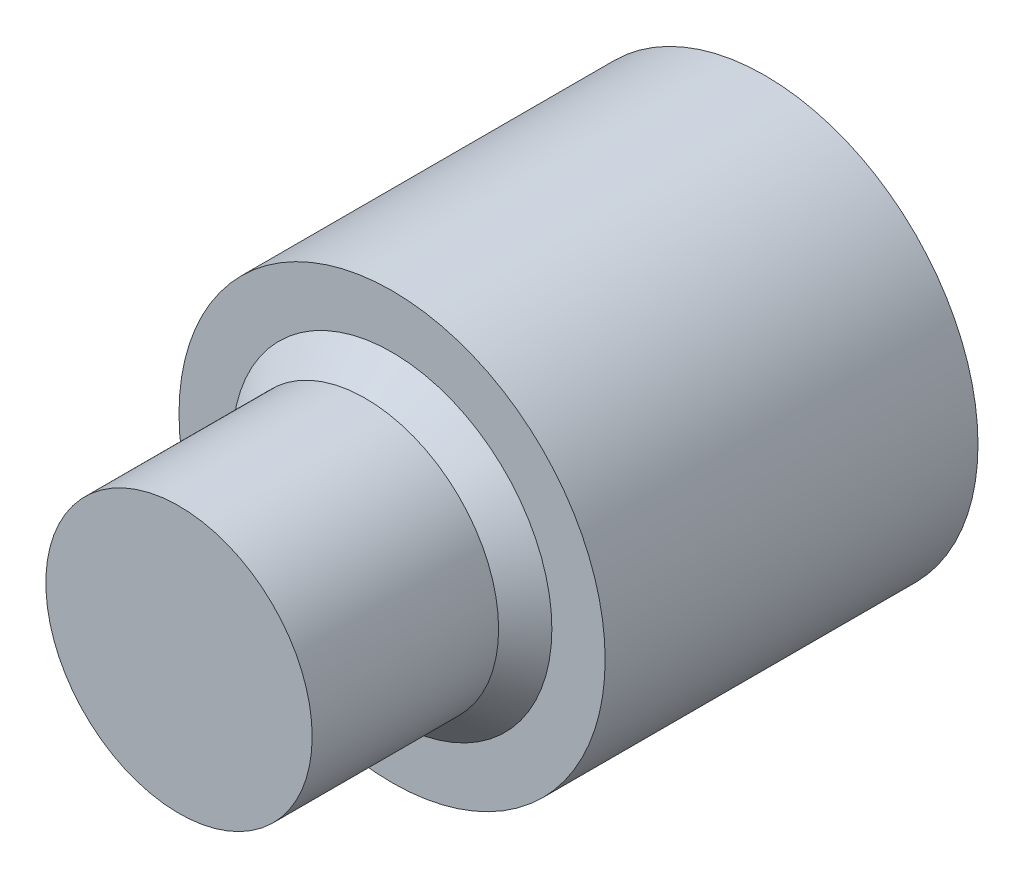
ISO-10303-21;
HEADER;
FILE_DESCRIPTION(('STEP AP214'),'2;1');
FILE_NAME('part.step','',(''),(''),'','','');
FILE_SCHEMA(('AUTOMOTIVE_DESIGN { 1 0 10303 214 1 1 1 1 }'));
ENDSEC;
DATA;
#1=APPLICATION_CONTEXT('core data for automotive mechanical design processes');
#2=APPLICATION_PROTOCOL_DEFINITION('international standard','automotive_design',2000,#1);
#3=PRODUCT_CONTEXT('',#1,'mechanical');
#4=PRODUCT('Part','Part','',(#3));
#5=PRODUCT_RELATED_PRODUCT_CATEGORY('part','',(#4));
#6=PRODUCT_DEFINITION_FORMATION('','',#4);
#7=PRODUCT_DEFINITION_CONTEXT('part definition',#1,'design');
#8=PRODUCT_DEFINITION('design','',#6,#7);
#9=PRODUCT_DEFINITION_SHAPE('','',#8);
#10=(LENGTH_UNIT() NAMED_UNIT(*) SI_UNIT(.MILLI.,.METRE.));
#11=(NAMED_UNIT(*) PLANE_ANGLE_UNIT() SI_UNIT($,.RADIAN.));
#12=(NAMED_UNIT(*) SI_UNIT($,.STERADIAN.) SOLID_ANGLE_UNIT());
#13=UNCERTAINTY_MEASURE_WITH_UNIT(LENGTH_MEASURE(1.E-05),#10,'distance_accuracy_value','');
#14=(GEOMETRIC_REPRESENTATION_CONTEXT(3) GLOBAL_UNCERTAINTY_ASSIGNED_CONTEXT((#13)) GLOBAL_UNIT_ASSIGNED_CONTEXT((#10,
#11,#12)) REPRESENTATION_CONTEXT('',''));
#15=CARTESIAN_POINT('',(0.,0.,0.));
#16=DIRECTION('',(0.,0.,1.));
#17=DIRECTION('',(1.,0.,0.));
#18=AXIS2_PLACEMENT_3D('',#15,#16,#17);
#19=CARTESIAN_POINT('',(0.,0.,7.));
#20=DIRECTION('',(0.,0.,-1.));
#21=DIRECTION('',(-1.,0.,0.));
#22=AXIS2_PLACEMENT_3D('',#19,#20,#21);
#23=CYLINDRICAL_SURFACE('',#22,4.);
#24=CARTESIAN_POINT('',(0.,0.,7.));
#25=DIRECTION('',(0.,0.,1.));
#26=DIRECTION('',(1.,0.,0.));
#27=AXIS2_PLACEMENT_3D('',#24,#25,#26);
#28=CIRCLE('',#27,4.);
#29=CARTESIAN_POINT('',(4.,0.,7.));
#30=VERTEX_POINT('',#29);
#31=EDGE_CURVE('E45',#30,#30,#28,.T.);
#32=ORIENTED_EDGE('',*,*,#31,.F.);
#33=EDGE_LOOP('',(#32));
#34=FACE_BOUND('',#33,.T.);
#35=CARTESIAN_POINT('',(0.,0.,0.));
#36=DIRECTION('',(0.,0.,1.));
#37=DIRECTION('',(1.,0.,0.));
#38=AXIS2_PLACEMENT_3D('',#35,#36,#37);
#39=CIRCLE('',#38,4.);
#40=CARTESIAN_POINT('',(4.,0.,0.));
#41=VERTEX_POINT('',#40);
#42=EDGE_CURVE('E40',#41,#41,#39,.T.);
#43=ORIENTED_EDGE('',*,*,#42,.T.);
#44=EDGE_LOOP('',(#43));
#45=FACE_BOUND('',#44,.T.);
#46=ADVANCED_FACE('F37',(#34,#45),#23,.T.);
#47=CARTESIAN_POINT('',(0.,0.,7.));
#48=DIRECTION('',(0.,0.,1.));
#49=DIRECTION('',(1.,0.,0.));
#50=AXIS2_PLACEMENT_3D('',#47,#48,#49);
#51=PLANE('',#50);
#52=CARTESIAN_POINT('',(0.,0.,7.));
#53=DIRECTION('',(0.,0.,1.));
#54=DIRECTION('',(1.,0.,0.));
#55=AXIS2_PLACEMENT_3D('',#52,#53,#54);
#56=CIRCLE('',#55,3.);
#57=CARTESIAN_POINT('',(3.,0.,7.));
#58=VERTEX_POINT('',#57);
#59=EDGE_CURVE('E10',#58,#58,#56,.T.);
#60=ORIENTED_EDGE('',*,*,#59,.F.);
#61=EDGE_LOOP('',(#60));
#62=FACE_BOUND('',#61,.T.);
#63=ORIENTED_EDGE('',*,*,#31,.T.);
#64=EDGE_LOOP('',(#63));
#65=FACE_BOUND('',#64,.T.);
#66=ADVANCED_FACE('F80',(#62,#65),#51,.T.);
#67=CARTESIAN_POINT('',(0.,0.,0.));
#68=DIRECTION('',(0.,0.,1.));
#69=DIRECTION('',(1.,0.,0.));
#70=AXIS2_PLACEMENT_3D('',#67,#68,#69);
#71=PLANE('',#70);
#72=ORIENTED_EDGE('',*,*,#42,.F.);
#73=EDGE_LOOP('',(#72));
#74=FACE_BOUND('',#73,.T.);
#75=ADVANCED_FACE('F76',(#74),#71,.F.);
#76=CARTESIAN_POINT('',(0.,0.,7.));
#77=DIRECTION('',(0.,0.,-1.));
#78=DIRECTION('',(1.,0.,0.));
#79=AXIS2_PLACEMENT_3D('',#76,#77,#78);
#80=CONICAL_SURFACE('',#79,3.,0.78539816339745);
#81=CARTESIAN_POINT('',(0.,0.,7.5));
#82=DIRECTION('',(0.,0.,1.));
#83=DIRECTION('',(1.,0.,0.));
#84=AXIS2_PLACEMENT_3D('',#81,#82,#83);
#85=CIRCLE('',#84,2.5);
#86=CARTESIAN_POINT('',(2.5,0.,7.5));
#87=VERTEX_POINT('',#86);
#88=EDGE_CURVE('E54',#87,#87,#85,.T.);
#89=ORIENTED_EDGE('',*,*,#88,.F.);
#90=EDGE_LOOP('',(#89));
#91=FACE_BOUND('',#90,.T.);
#92=ORIENTED_EDGE('',*,*,#59,.T.);
#93=EDGE_LOOP('',(#92));
#94=FACE_BOUND('',#93,.T.);
#95=ADVANCED_FACE('F69',(#91,#94),#80,.T.);
#96=CARTESIAN_POINT('',(0.,0.,11.));
#97=DIRECTION('',(0.,0.,-1.));
#98=DIRECTION('',(-1.,0.,0.));
#99=AXIS2_PLACEMENT_3D('',#96,#97,#98);
#100=CYLINDRICAL_SURFACE('',#99,2.5);
#101=CARTESIAN_POINT('',(0.,0.,11.));
#102=DIRECTION('',(0.,0.,1.));
#103=DIRECTION('',(1.,0.,0.));
#104=AXIS2_PLACEMENT_3D('',#101,#102,#103);
#105=CIRCLE('',#104,2.5);
#106=CARTESIAN_POINT('',(2.5,0.,11.));
#107=VERTEX_POINT('',#106);
#108=EDGE_CURVE('E53',#107,#107,#105,.T.);
#109=ORIENTED_EDGE('',*,*,#108,.F.);
#110=EDGE_LOOP('',(#109));
#111=FACE_BOUND('',#110,.T.);
#112=ORIENTED_EDGE('',*,*,#88,.T.);
#113=EDGE_LOOP('',(#112));
#114=FACE_BOUND('',#113,.T.);
#115=ADVANCED_FACE('F67',(#111,#114),#100,.T.);
#116=CARTESIAN_POINT('',(0.,0.,11.));
#117=DIRECTION('',(0.,0.,1.));
#118=DIRECTION('',(1.,0.,0.));
#119=AXIS2_PLACEMENT_3D('',#116,#117,#118);
#120=PLANE('',#119);
#121=ORIENTED_EDGE('',*,*,#108,.T.);
#122=EDGE_LOOP('',(#121));
#123=FACE_BOUND('',#122,.T.);
#124=ADVANCED_FACE('F65',(#123),#120,.T.);
#125=CLOSED_SHELL('',(#46,#66,#75,#95,#115,#124));
#126=MANIFOLD_SOLID_BREP('B2',#125);
#127=ADVANCED_BREP_SHAPE_REPRESENTATION('',(#18,#126),#14);
#128=SHAPE_DEFINITION_REPRESENTATION(#9,#127);
ENDSEC;
END-ISO-10303-21;
